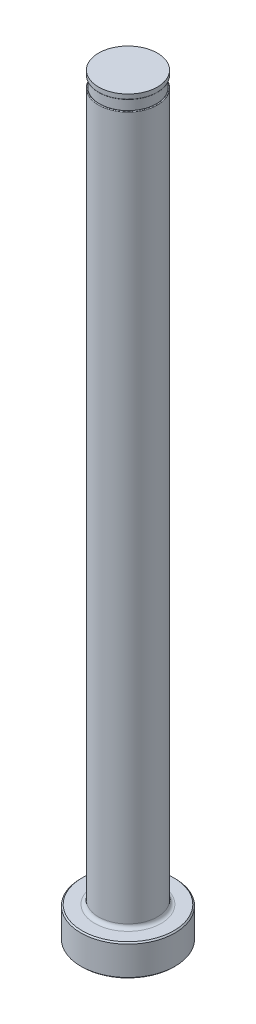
ISO-10303-21;
HEADER;
FILE_DESCRIPTION(('STEP AP214'),'2;1');
FILE_NAME('part.step','',(''),(''),'','','');
FILE_SCHEMA(('AUTOMOTIVE_DESIGN { 1 0 10303 214 1 1 1 1 }'));
ENDSEC;
DATA;
#1=APPLICATION_CONTEXT('core data for automotive mechanical design processes');
#2=APPLICATION_PROTOCOL_DEFINITION('international standard','automotive_design',2000,#1);
#3=PRODUCT_CONTEXT('',#1,'mechanical');
#4=PRODUCT('Part','Part','',(#3));
#5=PRODUCT_RELATED_PRODUCT_CATEGORY('part','',(#4));
#6=PRODUCT_DEFINITION_FORMATION('','',#4);
#7=PRODUCT_DEFINITION_CONTEXT('part definition',#1,'design');
#8=PRODUCT_DEFINITION('design','',#6,#7);
#9=PRODUCT_DEFINITION_SHAPE('','',#8);
#10=(LENGTH_UNIT() NAMED_UNIT(*) SI_UNIT(.MILLI.,.METRE.));
#11=(NAMED_UNIT(*) PLANE_ANGLE_UNIT() SI_UNIT($,.RADIAN.));
#12=(NAMED_UNIT(*) SI_UNIT($,.STERADIAN.) SOLID_ANGLE_UNIT());
#13=UNCERTAINTY_MEASURE_WITH_UNIT(LENGTH_MEASURE(1.E-05),#10,'distance_accuracy_value','');
#14=(GEOMETRIC_REPRESENTATION_CONTEXT(3) GLOBAL_UNCERTAINTY_ASSIGNED_CONTEXT((#13)) GLOBAL_UNIT_ASSIGNED_CONTEXT((#10,
#11,#12)) REPRESENTATION_CONTEXT('',''));
#15=CARTESIAN_POINT('',(0.,0.,0.));
#16=DIRECTION('',(0.,0.,1.));
#17=DIRECTION('',(1.,0.,0.));
#18=AXIS2_PLACEMENT_3D('',#15,#16,#17);
#19=CARTESIAN_POINT('',(-5.95248999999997,151.384,0.));
#20=DIRECTION('',(0.,1.,0.));
#21=DIRECTION('',(0.,0.,1.));
#22=AXIS2_PLACEMENT_3D('',#19,#20,#21);
#23=PLANE('',#22);
#24=CARTESIAN_POINT('',(0.,151.384,0.));
#25=DIRECTION('',(0.,1.,0.));
#26=DIRECTION('',(0.,0.,1.));
#27=AXIS2_PLACEMENT_3D('',#24,#25,#26);
#28=CIRCLE('',#27,5.82040999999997);
#29=CARTESIAN_POINT('',(0.,151.384,5.82040999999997));
#30=VERTEX_POINT('',#29);
#31=EDGE_CURVE('E11',#30,#30,#28,.F.);
#32=ORIENTED_EDGE('',*,*,#31,.T.);
#33=EDGE_LOOP('',(#32));
#34=FACE_BOUND('',#33,.T.);
#35=CARTESIAN_POINT('',(0.,151.384,0.));
#36=DIRECTION('',(0.,1.,0.));
#37=DIRECTION('',(0.,0.,1.));
#38=AXIS2_PLACEMENT_3D('',#35,#36,#37);
#39=CIRCLE('',#38,5.74928999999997);
#40=CARTESIAN_POINT('',(0.,151.384,5.74928999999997));
#41=VERTEX_POINT('',#40);
#42=EDGE_CURVE('E78',#41,#41,#39,.T.);
#43=ORIENTED_EDGE('',*,*,#42,.T.);
#44=EDGE_LOOP('',(#43));
#45=FACE_BOUND('',#44,.T.);
#46=ADVANCED_FACE('F36',(#34,#45),#23,.F.);
#47=CARTESIAN_POINT('',(0.,259.958771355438,0.));
#48=DIRECTION('',(0.,1.,0.));
#49=DIRECTION('',(0.,0.,1.));
#50=AXIS2_PLACEMENT_3D('',#47,#48,#49);
#51=CYLINDRICAL_SURFACE('',#50,5.95248999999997);
#52=DIRECTION('',(0.,1.,0.));
#53=VECTOR('',#52,1.);
#54=CARTESIAN_POINT('',(-5.74928999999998,259.958771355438,-1.5420122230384));
#55=LINE('',#54,#53);
#56=CARTESIAN_POINT('',(-5.74928999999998,149.225,-1.5420122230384));
#57=VERTEX_POINT('',#56);
#58=CARTESIAN_POINT('',(-5.74928999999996,86.868,-1.54201222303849));
#59=VERTEX_POINT('',#58);
#60=EDGE_CURVE('E73',#57,#59,#55,.F.);
#61=ORIENTED_EDGE('',*,*,#60,.F.);
#62=CARTESIAN_POINT('',(0.,149.225,0.));
#63=DIRECTION('',(0.,-1.,0.));
#64=DIRECTION('',(0.,0.,-1.));
#65=AXIS2_PLACEMENT_3D('',#62,#63,#64);
#66=CIRCLE('',#65,5.95248999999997);
#67=CARTESIAN_POINT('',(-5.74928999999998,149.225,1.5420122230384));
#68=VERTEX_POINT('',#67);
#69=EDGE_CURVE('E51',#57,#68,#66,.T.);
#70=ORIENTED_EDGE('',*,*,#69,.T.);
#71=DIRECTION('',(0.,1.,0.));
#72=VECTOR('',#71,1.);
#73=CARTESIAN_POINT('',(-5.74928999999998,259.958771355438,1.5420122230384));
#74=LINE('',#73,#72);
#75=CARTESIAN_POINT('',(-5.74928999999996,86.868,1.54201222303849));
#76=VERTEX_POINT('',#75);
#77=EDGE_CURVE('E84',#76,#68,#74,.T.);
#78=ORIENTED_EDGE('',*,*,#77,.F.);
#79=CARTESIAN_POINT('',(-5.74928999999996,86.868,-1.54201222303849));
#80=CARTESIAN_POINT('',(-5.7492869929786,86.8402208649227,-1.54201697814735));
#81=CARTESIAN_POINT('',(-5.74965505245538,86.8124610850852,-1.5406516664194));
#82=CARTESIAN_POINT('',(-5.75110274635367,86.7572460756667,-1.53524151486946));
#83=CARTESIAN_POINT('',(-5.75218176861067,86.7297906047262,-1.53119898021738));
#84=CARTESIAN_POINT('',(-5.75641075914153,86.6487767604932,-1.51525486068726));
#85=CARTESIAN_POINT('',(-5.76055400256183,86.5959793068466,-1.49953379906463));
#86=CARTESIAN_POINT('',(-5.77092696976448,86.4944513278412,-1.45909687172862));
#87=CARTESIAN_POINT('',(-5.77715061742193,86.445709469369,-1.43440718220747));
#88=CARTESIAN_POINT('',(-5.79098788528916,86.3529780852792,-1.37748193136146));
#89=CARTESIAN_POINT('',(-5.7986047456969,86.3090000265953,-1.34522872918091));
#90=CARTESIAN_POINT('',(-5.81685908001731,86.2141849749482,-1.26430278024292));
#91=CARTESIAN_POINT('',(-5.82772577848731,86.1651387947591,-1.21359133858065));
#92=CARTESIAN_POINT('',(-5.84932001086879,86.0759814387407,-1.10484574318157));
#93=CARTESIAN_POINT('',(-5.86004729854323,86.0358844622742,-1.04680017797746));
#94=CARTESIAN_POINT('',(-5.88390059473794,85.9519339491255,-0.904778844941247));
#95=CARTESIAN_POINT('',(-5.89659263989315,85.9114837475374,-0.818723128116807));
#96=CARTESIAN_POINT('',(-5.91855552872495,85.8445666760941,-0.641010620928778));
#97=CARTESIAN_POINT('',(-5.92782357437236,85.8181112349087,-0.549349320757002));
#98=CARTESIAN_POINT('',(-5.94230780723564,85.7776429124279,-0.360889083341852));
#99=CARTESIAN_POINT('',(-5.94742894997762,85.7639208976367,-0.2640211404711));
#100=CARTESIAN_POINT('',(-5.95288793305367,85.749318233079,-0.0691558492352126));
#101=CARTESIAN_POINT('',(-5.95322242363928,85.7484465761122,0.0288422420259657));
#102=CARTESIAN_POINT('',(-5.94868446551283,85.7605404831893,0.242237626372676));
#103=CARTESIAN_POINT('',(-5.94283113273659,85.7761121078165,0.357477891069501));
#104=CARTESIAN_POINT('',(-5.92492015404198,85.8263022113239,0.583281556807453));
#105=CARTESIAN_POINT('',(-5.91286985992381,85.8608981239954,0.69385033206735));
#106=CARTESIAN_POINT('',(-5.88892429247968,85.9362489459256,0.870563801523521));
#107=CARTESIAN_POINT('',(-5.87828331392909,85.9712292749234,0.939352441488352));
#108=CARTESIAN_POINT('',(-5.85581507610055,86.0514071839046,1.07049428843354));
#109=CARTESIAN_POINT('',(-5.8439898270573,86.0965876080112,1.13285804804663));
#110=CARTESIAN_POINT('',(-5.82307219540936,86.1863208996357,1.2353431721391));
#111=CARTESIAN_POINT('',(-5.81396107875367,86.2287467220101,1.27731748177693));
#112=CARTESIAN_POINT('',(-5.79660025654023,86.3199777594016,1.35392068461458));
#113=CARTESIAN_POINT('',(-5.78834968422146,86.3687764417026,1.38855700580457));
#114=CARTESIAN_POINT('',(-5.77487399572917,86.4634137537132,1.44347959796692));
#115=CARTESIAN_POINT('',(-5.76937362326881,86.5083804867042,1.46519744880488));
#116=CARTESIAN_POINT('',(-5.76015985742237,86.6013997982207,1.50101335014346));
#117=CARTESIAN_POINT('',(-5.75644319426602,86.6494465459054,1.51512534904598));
#118=CARTESIAN_POINT('',(-5.75233279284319,86.7262424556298,1.53063311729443));
#119=CARTESIAN_POINT('',(-5.75119737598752,86.754400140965,1.53488770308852));
#120=CARTESIAN_POINT('',(-5.74967384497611,86.8110323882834,1.54058135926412));
#121=CARTESIAN_POINT('',(-5.74928611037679,86.8395071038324,1.54201899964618));
#122=CARTESIAN_POINT('',(-5.74928999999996,86.868,1.54201222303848));
#123=B_SPLINE_CURVE_WITH_KNOTS('',3,(#79,#80,#81,#82,#83,#84,#85,#86,#87,#88,#89,#90,#91,#92,
#93,#94,#95,#96,#97,#98,#99,#100,#101,#102,#103,#104,#105,#106,#107,#108,#109,#110,#111,#112,
#113,#114,#115,#116,#117,#118,#119,#120,#121,#122),.UNSPECIFIED.,.F.,.F.,(4,2,2,2,2,2,2,2,2,2,2,
2,2,2,2,2,2,2,2,2,2,4),(0.,0.0832648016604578,0.166458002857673,0.331100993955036,
0.495267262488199,0.659820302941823,0.872804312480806,1.08612389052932,1.37238232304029,
1.65887416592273,1.95175985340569,2.24485049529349,2.59250114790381,2.939740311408,
3.17269488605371,3.40526052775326,3.58572381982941,3.7660035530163,3.91610532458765,
4.06593087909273,4.15129340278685,4.23669924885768),.UNSPECIFIED.);
#124=EDGE_CURVE('E81',#59,#76,#123,.T.);
#125=ORIENTED_EDGE('',*,*,#124,.F.);
#126=EDGE_LOOP('',(#61,#70,#78,#125));
#127=FACE_BOUND('',#126,.T.);
#128=CARTESIAN_POINT('',(0.,7.11200000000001,0.));
#129=DIRECTION('',(0.,1.,0.));
#130=DIRECTION('',(0.,0.,1.));
#131=AXIS2_PLACEMENT_3D('',#128,#129,#130);
#132=CIRCLE('',#131,5.95248999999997);
#133=CARTESIAN_POINT('',(0.,7.11200000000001,5.95248999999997));
#134=VERTEX_POINT('',#133);
#135=EDGE_CURVE('E116',#134,#134,#132,.T.);
#136=ORIENTED_EDGE('',*,*,#135,.T.);
#137=EDGE_LOOP('',(#136));
#138=FACE_BOUND('',#137,.T.);
#139=ADVANCED_FACE('F82',(#127,#138),#51,.T.);
#140=CARTESIAN_POINT('',(0.,0.,0.));
#141=DIRECTION('',(0.,-1.,0.));
#142=DIRECTION('',(0.,0.,-1.));
#143=AXIS2_PLACEMENT_3D('',#140,#141,#142);
#144=PLANE('',#143);
#145=CARTESIAN_POINT('',(0.,0.,0.));
#146=DIRECTION('',(0.,-1.,0.));
#147=DIRECTION('',(0.,0.,-1.));
#148=AXIS2_PLACEMENT_3D('',#145,#146,#147);
#149=CIRCLE('',#148,9.271);
#150=CARTESIAN_POINT('',(0.,0.,-9.271));
#151=VERTEX_POINT('',#150);
#152=EDGE_CURVE('E113',#151,#151,#149,.T.);
#153=ORIENTED_EDGE('',*,*,#152,.T.);
#154=EDGE_LOOP('',(#153));
#155=FACE_BOUND('',#154,.T.);
#156=ADVANCED_FACE('F192',(#155),#144,.T.);
#157=CARTESIAN_POINT('',(0.,259.958771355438,0.));
#158=DIRECTION('',(0.,1.,0.));
#159=DIRECTION('',(0.,0.,1.));
#160=AXIS2_PLACEMENT_3D('',#157,#158,#159);
#161=CYLINDRICAL_SURFACE('',#160,9.52499999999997);
#162=CARTESIAN_POINT('',(0.,6.09600000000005,0.));
#163=DIRECTION('',(0.,1.,0.));
#164=DIRECTION('',(0.,0.,1.));
#165=AXIS2_PLACEMENT_3D('',#162,#163,#164);
#166=CIRCLE('',#165,9.52499999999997);
#167=CARTESIAN_POINT('',(0.,6.09600000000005,9.52499999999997));
#168=VERTEX_POINT('',#167);
#169=EDGE_CURVE('E110',#168,#168,#166,.F.);
#170=ORIENTED_EDGE('',*,*,#169,.T.);
#171=EDGE_LOOP('',(#170));
#172=FACE_BOUND('',#171,.T.);
#173=CARTESIAN_POINT('',(0.,0.253999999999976,0.));
#174=DIRECTION('',(0.,-1.,0.));
#175=DIRECTION('',(0.,0.,-1.));
#176=AXIS2_PLACEMENT_3D('',#173,#174,#175);
#177=CIRCLE('',#176,9.52499999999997);
#178=CARTESIAN_POINT('',(0.,0.253999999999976,-9.52499999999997));
#179=VERTEX_POINT('',#178);
#180=EDGE_CURVE('E107',#179,#179,#177,.F.);
#181=ORIENTED_EDGE('',*,*,#180,.T.);
#182=EDGE_LOOP('',(#181));
#183=FACE_BOUND('',#182,.T.);
#184=ADVANCED_FACE('F195',(#172,#183),#161,.T.);
#185=CARTESIAN_POINT('',(-9.52499999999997,6.35,0.));
#186=DIRECTION('',(0.,1.,0.));
#187=DIRECTION('',(0.,0.,1.));
#188=AXIS2_PLACEMENT_3D('',#185,#186,#187);
#189=PLANE('',#188);
#190=CARTESIAN_POINT('',(0.,6.35,0.));
#191=DIRECTION('',(0.,1.,0.));
#192=DIRECTION('',(0.,0.,1.));
#193=AXIS2_PLACEMENT_3D('',#190,#191,#192);
#194=CIRCLE('',#193,6.71448999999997);
#195=CARTESIAN_POINT('',(0.,6.35,6.71448999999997));
#196=VERTEX_POINT('',#195);
#197=EDGE_CURVE('E87',#196,#196,#194,.F.);
#198=ORIENTED_EDGE('',*,*,#197,.T.);
#199=EDGE_LOOP('',(#198));
#200=FACE_BOUND('',#199,.T.);
#201=CARTESIAN_POINT('',(0.,6.35,0.));
#202=DIRECTION('',(0.,1.,0.));
#203=DIRECTION('',(0.,0.,1.));
#204=AXIS2_PLACEMENT_3D('',#201,#202,#203);
#205=CIRCLE('',#204,9.27100000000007);
#206=CARTESIAN_POINT('',(0.,6.35,9.27100000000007));
#207=VERTEX_POINT('',#206);
#208=EDGE_CURVE('E104',#207,#207,#205,.T.);
#209=ORIENTED_EDGE('',*,*,#208,.T.);
#210=EDGE_LOOP('',(#209));
#211=FACE_BOUND('',#210,.T.);
#212=ADVANCED_FACE('F190',(#200,#211),#189,.T.);
#213=CARTESIAN_POINT('',(0.,6.35000000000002,0.));
#214=DIRECTION('',(0.,-1.,0.));
#215=DIRECTION('',(0.,0.,-1.));
#216=AXIS2_PLACEMENT_3D('',#213,#214,#215);
#217=CONICAL_SURFACE('',#216,9.27100000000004,0.785398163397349);
#218=ORIENTED_EDGE('',*,*,#169,.F.);
#219=EDGE_LOOP('',(#218));
#220=FACE_BOUND('',#219,.T.);
#221=ORIENTED_EDGE('',*,*,#208,.F.);
#222=EDGE_LOOP('',(#221));
#223=FACE_BOUND('',#222,.T.);
#224=ADVANCED_FACE('F186',(#220,#223),#217,.T.);
#225=CARTESIAN_POINT('',(0.,0.253999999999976,0.));
#226=DIRECTION('',(0.,1.,0.));
#227=DIRECTION('',(0.,0.,1.));
#228=AXIS2_PLACEMENT_3D('',#225,#226,#227);
#229=CONICAL_SURFACE('',#228,9.52499999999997,0.785398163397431);
#230=ORIENTED_EDGE('',*,*,#152,.F.);
#231=EDGE_LOOP('',(#230));
#232=FACE_BOUND('',#231,.T.);
#233=ORIENTED_EDGE('',*,*,#180,.F.);
#234=EDGE_LOOP('',(#233));
#235=FACE_BOUND('',#234,.T.);
#236=ADVANCED_FACE('F182',(#232,#235),#229,.T.);
#237=CARTESIAN_POINT('',(0.,7.11200000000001,0.));
#238=DIRECTION('',(0.,1.,0.));
#239=DIRECTION('',(0.,0.,1.));
#240=AXIS2_PLACEMENT_3D('',#237,#238,#239);
#241=TOROIDAL_SURFACE('',#240,6.71448999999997,0.762);
#242=ORIENTED_EDGE('',*,*,#197,.F.);
#243=EDGE_LOOP('',(#242));
#244=FACE_BOUND('',#243,.T.);
#245=ORIENTED_EDGE('',*,*,#135,.F.);
#246=EDGE_LOOP('',(#245));
#247=FACE_BOUND('',#246,.T.);
#248=ADVANCED_FACE('F147',(#244,#247),#241,.F.);
#249=CARTESIAN_POINT('',(-5.95248999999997,149.352,0.));
#250=DIRECTION('',(0.,-1.,0.));
#251=DIRECTION('',(0.,0.,-1.));
#252=AXIS2_PLACEMENT_3D('',#249,#250,#251);
#253=PLANE('',#252);
#254=DIRECTION('',(0.,0.,1.));
#255=VECTOR('',#254,1.);
#256=CARTESIAN_POINT('',(-5.74928999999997,149.352,0.));
#257=LINE('',#256,#255);
#258=CARTESIAN_POINT('',(-5.74928999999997,149.352,0.));
#259=VERTEX_POINT('',#258);
#260=CARTESIAN_POINT('',(-5.74928999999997,149.352,0.939147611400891));
#261=VERTEX_POINT('',#260);
#262=EDGE_CURVE('E90',#259,#261,#257,.T.);
#263=ORIENTED_EDGE('',*,*,#262,.T.);
#264=CARTESIAN_POINT('',(0.,149.352,0.));
#265=DIRECTION('',(0.,-1.,0.));
#266=DIRECTION('',(0.,0.,-1.));
#267=AXIS2_PLACEMENT_3D('',#264,#265,#266);
#268=CIRCLE('',#267,5.82548999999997);
#269=CARTESIAN_POINT('',(-5.74928999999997,149.352,-0.939147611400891));
#270=VERTEX_POINT('',#269);
#271=EDGE_CURVE('E86',#261,#270,#268,.F.);
#272=ORIENTED_EDGE('',*,*,#271,.T.);
#273=EDGE_CURVE('E79',#270,#259,#257,.T.);
#274=ORIENTED_EDGE('',*,*,#273,.T.);
#275=CARTESIAN_POINT('',(0.,149.352,0.));
#276=DIRECTION('',(0.,1.,0.));
#277=DIRECTION('',(0.,0.,1.));
#278=AXIS2_PLACEMENT_3D('',#275,#276,#277);
#279=CIRCLE('',#278,5.74928999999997);
#280=EDGE_CURVE('E101',#259,#259,#279,.T.);
#281=ORIENTED_EDGE('',*,*,#280,.F.);
#282=EDGE_LOOP('',(#263,#272,#274,#281));
#283=FACE_BOUND('',#282,.T.);
#284=ADVANCED_FACE('F144',(#283),#253,.F.);
#285=CARTESIAN_POINT('',(0.,153.448281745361,0.));
#286=DIRECTION('',(0.,1.,0.));
#287=DIRECTION('',(0.,0.,1.));
#288=AXIS2_PLACEMENT_3D('',#285,#286,#287);
#289=CYLINDRICAL_SURFACE('',#288,5.74928999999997);
#290=ORIENTED_EDGE('',*,*,#42,.F.);
#291=EDGE_LOOP('',(#290));
#292=FACE_BOUND('',#291,.T.);
#293=ORIENTED_EDGE('',*,*,#280,.T.);
#294=EDGE_LOOP('',(#293));
#295=FACE_BOUND('',#294,.T.);
#296=ADVANCED_FACE('F141',(#292,#295),#289,.T.);
#297=CARTESIAN_POINT('',(-5.74928999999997,150.368,-9.52499999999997));
#298=DIRECTION('',(1.,0.,0.));
#299=DIRECTION('',(0.,1.,0.));
#300=AXIS2_PLACEMENT_3D('',#297,#298,#299);
#301=PLANE('',#300);
#302=ORIENTED_EDGE('',*,*,#273,.F.);
#303=CARTESIAN_POINT('',(-5.74928999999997,149.352,-0.939147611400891));
#304=CARTESIAN_POINT('',(-5.74928999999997,149.351999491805,-0.960313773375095));
#305=CARTESIAN_POINT('',(-5.74928999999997,149.351863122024,-0.981479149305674));
#306=CARTESIAN_POINT('',(-5.74928999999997,149.351255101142,-1.02381131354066));
#307=CARTESIAN_POINT('',(-5.74928999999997,149.350783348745,-1.0449781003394));
#308=CARTESIAN_POINT('',(-5.74928999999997,149.348768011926,-1.10851964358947));
#309=CARTESIAN_POINT('',(-5.74928999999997,149.346624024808,-1.15088175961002));
#310=CARTESIAN_POINT('',(-5.74928999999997,149.341688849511,-1.21286687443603));
#311=CARTESIAN_POINT('',(-5.74928999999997,149.339853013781,-1.23256518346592));
#312=CARTESIAN_POINT('',(-5.74928999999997,149.335501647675,-1.27188290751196));
#313=CARTESIAN_POINT('',(-5.74928999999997,149.332986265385,-1.2915023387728));
#314=CARTESIAN_POINT('',(-5.74928999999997,149.325966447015,-1.33801228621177));
#315=CARTESIAN_POINT('',(-5.74928999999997,149.321069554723,-1.36484781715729));
#316=CARTESIAN_POINT('',(-5.74928999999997,149.310495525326,-1.40986464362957));
#317=CARTESIAN_POINT('',(-5.74928999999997,149.305508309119,-1.42819643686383));
#318=CARTESIAN_POINT('',(-5.74928999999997,149.296514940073,-1.45484549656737));
#319=CARTESIAN_POINT('',(-5.74928999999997,149.293335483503,-1.46343850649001));
#320=CARTESIAN_POINT('',(-5.74928999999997,149.28627591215,-1.48034059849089));
#321=CARTESIAN_POINT('',(-5.74928999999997,149.282396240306,-1.48864985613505));
#322=CARTESIAN_POINT('',(-5.74928999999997,149.275506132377,-1.50120056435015));
#323=CARTESIAN_POINT('',(-5.74928999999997,149.272853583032,-1.50563682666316));
#324=CARTESIAN_POINT('',(-5.74928999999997,149.267101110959,-1.51421595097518));
#325=CARTESIAN_POINT('',(-5.74928999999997,149.26400162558,-1.51835909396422));
#326=CARTESIAN_POINT('',(-5.74928999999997,149.258471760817,-1.52466635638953));
#327=CARTESIAN_POINT('',(-5.74928999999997,149.25622570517,-1.52699040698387));
#328=CARTESIAN_POINT('',(-5.74928999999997,149.251445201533,-1.53132640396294));
#329=CARTESIAN_POINT('',(-5.74928999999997,149.248911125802,-1.53333874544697));
#330=CARTESIAN_POINT('',(-5.74928999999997,149.244334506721,-1.53634422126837));
#331=CARTESIAN_POINT('',(-5.74928999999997,149.242374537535,-1.53746164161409));
#332=CARTESIAN_POINT('',(-5.74928999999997,149.238307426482,-1.53937528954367));
#333=CARTESIAN_POINT('',(-5.74928999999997,149.236200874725,-1.54017272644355));
#334=CARTESIAN_POINT('',(-5.74928999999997,149.2325728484,-1.54117250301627));
#335=CARTESIAN_POINT('',(-5.74928999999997,149.231081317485,-1.54148377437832));
#336=CARTESIAN_POINT('',(-5.74928999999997,149.228060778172,-1.54190531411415));
#337=CARTESIAN_POINT('',(-5.74928999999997,149.226531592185,-1.54201429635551));
#338=CARTESIAN_POINT('',(-5.74928999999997,149.225000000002,-1.54201222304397));
#339=B_SPLINE_CURVE_WITH_KNOTS('',3,(#303,#304,#305,#306,#307,#308,#309,#310,#311,#312,#313,
#314,#315,#316,#317,#318,#319,#320,#321,#322,#323,#324,#325,#326,#327,#328,#329,#330,#331,#332,
#333,#334,#335,#336,#337,#338),.UNSPECIFIED.,.F.,.F.,(4,2,2,2,2,2,2,2,2,2,2,2,2,2,2,2,2,4),(0.,
0.0634959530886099,0.127011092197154,0.254202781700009,0.313544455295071,0.372873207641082,
0.45462942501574,0.511527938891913,0.538997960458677,0.566450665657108,0.581940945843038,
0.597416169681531,0.607094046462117,0.616759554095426,0.623507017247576,0.630228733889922,
0.634786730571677,0.639373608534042),.UNSPECIFIED.);
#340=EDGE_CURVE('E59',#270,#57,#339,.T.);
#341=ORIENTED_EDGE('',*,*,#340,.T.);
#342=ORIENTED_EDGE('',*,*,#60,.T.);
#343=DIRECTION('',(0.,0.,1.));
#344=VECTOR('',#343,1.);
#345=CARTESIAN_POINT('',(-5.74928999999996,86.868,-9.52499999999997));
#346=LINE('',#345,#344);
#347=EDGE_CURVE('E77',#59,#76,#346,.T.);
#348=ORIENTED_EDGE('',*,*,#347,.T.);
#349=ORIENTED_EDGE('',*,*,#77,.T.);
#350=CARTESIAN_POINT('',(-5.74928999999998,149.225,1.5420122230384));
#351=CARTESIAN_POINT('',(-5.74928999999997,149.227261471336,1.54202038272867));
#352=CARTESIAN_POINT('',(-5.74928999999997,149.229510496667,1.54177946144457));
#353=CARTESIAN_POINT('',(-5.74928999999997,149.233887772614,1.54087970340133));
#354=CARTESIAN_POINT('',(-5.74928999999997,149.236017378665,1.54022760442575));
#355=CARTESIAN_POINT('',(-5.74928999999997,149.240617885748,1.53838865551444));
#356=CARTESIAN_POINT('',(-5.74928999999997,149.243052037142,1.53711237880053));
#357=CARTESIAN_POINT('',(-5.74928999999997,149.247698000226,1.53418694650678));
#358=CARTESIAN_POINT('',(-5.74928999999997,149.249908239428,1.53253538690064));
#359=CARTESIAN_POINT('',(-5.74928999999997,149.255730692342,1.52761233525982));
#360=CARTESIAN_POINT('',(-5.74928999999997,149.259112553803,1.52407243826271));
#361=CARTESIAN_POINT('',(-5.74928999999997,149.265360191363,1.51657566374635));
#362=CARTESIAN_POINT('',(-5.74928999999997,149.26822496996,1.51261800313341));
#363=CARTESIAN_POINT('',(-5.74928999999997,149.275008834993,1.50226117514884));
#364=CARTESIAN_POINT('',(-5.74928999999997,149.278667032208,1.49569302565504));
#365=CARTESIAN_POINT('',(-5.74928999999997,149.285372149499,1.48224724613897));
#366=CARTESIAN_POINT('',(-5.74928999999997,149.288417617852,1.47536892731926));
#367=CARTESIAN_POINT('',(-5.74928999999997,149.296912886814,1.45440029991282));
#368=CARTESIAN_POINT('',(-5.74928999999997,149.301686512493,1.44003865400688));
#369=CARTESIAN_POINT('',(-5.74928999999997,149.310114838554,1.41106200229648));
#370=CARTESIAN_POINT('',(-5.74928999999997,149.313772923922,1.39644790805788));
#371=CARTESIAN_POINT('',(-5.74928999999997,149.320305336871,1.36704254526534));
#372=CARTESIAN_POINT('',(-5.74928999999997,149.323179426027,1.35225122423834));
#373=CARTESIAN_POINT('',(-5.74928999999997,149.330936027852,1.30765909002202));
#374=CARTESIAN_POINT('',(-5.74928999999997,149.334935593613,1.27770752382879));
#375=CARTESIAN_POINT('',(-5.74928999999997,149.341413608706,1.21764271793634));
#376=CARTESIAN_POINT('',(-5.74928999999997,149.343891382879,1.18752941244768));
#377=CARTESIAN_POINT('',(-5.74928999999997,149.34774393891,1.12726865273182));
#378=CARTESIAN_POINT('',(-5.74928999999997,149.349119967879,1.09712127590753));
#379=CARTESIAN_POINT('',(-5.74928999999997,149.350769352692,1.04562383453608));
#380=CARTESIAN_POINT('',(-5.74928999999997,149.351247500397,1.02427949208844));
#381=CARTESIAN_POINT('',(-5.74928999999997,149.351861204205,0.981672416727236));
#382=CARTESIAN_POINT('',(-5.74928999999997,149.351998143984,0.960409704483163));
#383=CARTESIAN_POINT('',(-5.74928999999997,149.352,0.939147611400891));
#384=B_SPLINE_CURVE_WITH_KNOTS('',3,(#350,#351,#352,#353,#354,#355,#356,#357,#358,#359,#360,
#361,#362,#363,#364,#365,#366,#367,#368,#369,#370,#371,#372,#373,#374,#375,#376,#377,#378,#379,
#380,#381,#382,#383),.UNSPECIFIED.,.F.,.F.,(4,2,2,2,2,2,2,2,2,2,2,2,2,2,2,2,4),(0.,
0.00675172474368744,0.0133955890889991,0.0215941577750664,0.029846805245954,0.0444516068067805,
0.0590842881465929,0.0815815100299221,0.104131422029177,0.149443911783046,0.194617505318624,
0.239804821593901,0.3303875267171,0.421010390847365,0.51153052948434,0.575577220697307,
0.639363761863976),.UNSPECIFIED.);
#385=EDGE_CURVE('E172',#68,#261,#384,.T.);
#386=ORIENTED_EDGE('',*,*,#385,.T.);
#387=ORIENTED_EDGE('',*,*,#262,.F.);
#388=EDGE_LOOP('',(#302,#341,#342,#348,#349,#386,#387));
#389=FACE_BOUND('',#388,.T.);
#390=ADVANCED_FACE('F75',(#389),#301,.F.);
#391=CARTESIAN_POINT('',(-8.92428999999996,86.868,-9.52499999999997));
#392=DIRECTION('',(0.,0.,1.));
#393=DIRECTION('',(1.,0.,0.));
#394=AXIS2_PLACEMENT_3D('',#391,#392,#393);
#395=CYLINDRICAL_SURFACE('',#394,3.175);
#396=ORIENTED_EDGE('',*,*,#347,.F.);
#397=ORIENTED_EDGE('',*,*,#124,.T.);
#398=EDGE_LOOP('',(#396,#397));
#399=FACE_BOUND('',#398,.T.);
#400=ADVANCED_FACE('F89',(#399),#395,.F.);
#401=CARTESIAN_POINT('',(0.,152.687735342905,0.));
#402=DIRECTION('',(0.,1.,0.));
#403=DIRECTION('',(0.,0.,1.));
#404=AXIS2_PLACEMENT_3D('',#401,#402,#403);
#405=CYLINDRICAL_SURFACE('',#404,5.94740999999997);
#406=CARTESIAN_POINT('',(0.,151.511,0.));
#407=DIRECTION('',(0.,1.,0.));
#408=DIRECTION('',(0.,0.,1.));
#409=AXIS2_PLACEMENT_3D('',#406,#407,#408);
#410=CIRCLE('',#409,5.94740999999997);
#411=CARTESIAN_POINT('',(0.,151.511,5.94740999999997));
#412=VERTEX_POINT('',#411);
#413=EDGE_CURVE('E44',#412,#412,#410,.T.);
#414=ORIENTED_EDGE('',*,*,#413,.T.);
#415=EDGE_LOOP('',(#414));
#416=FACE_BOUND('',#415,.T.);
#417=CARTESIAN_POINT('',(0.,152.4,0.));
#418=DIRECTION('',(0.,1.,0.));
#419=DIRECTION('',(0.,0.,1.));
#420=AXIS2_PLACEMENT_3D('',#417,#418,#419);
#421=CIRCLE('',#420,5.94740999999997);
#422=CARTESIAN_POINT('',(0.,152.4,5.94740999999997));
#423=VERTEX_POINT('',#422);
#424=EDGE_CURVE('E91',#423,#423,#421,.T.);
#425=ORIENTED_EDGE('',*,*,#424,.F.);
#426=EDGE_LOOP('',(#425));
#427=FACE_BOUND('',#426,.T.);
#428=ADVANCED_FACE('F135',(#416,#427),#405,.T.);
#429=CARTESIAN_POINT('',(-5.95248999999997,152.4,0.));
#430=DIRECTION('',(0.,1.,0.));
#431=DIRECTION('',(0.,0.,1.));
#432=AXIS2_PLACEMENT_3D('',#429,#430,#431);
#433=PLANE('',#432);
#434=ORIENTED_EDGE('',*,*,#424,.T.);
#435=EDGE_LOOP('',(#434));
#436=FACE_BOUND('',#435,.T.);
#437=ADVANCED_FACE('F149',(#436),#433,.T.);
#438=CARTESIAN_POINT('',(0.,149.225,0.));
#439=DIRECTION('',(0.,-1.,0.));
#440=DIRECTION('',(0.,0.,-1.));
#441=AXIS2_PLACEMENT_3D('',#438,#439,#440);
#442=TOROIDAL_SURFACE('',#441,5.82548999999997,0.127);
#443=ORIENTED_EDGE('',*,*,#385,.F.);
#444=ORIENTED_EDGE('',*,*,#69,.F.);
#445=ORIENTED_EDGE('',*,*,#340,.F.);
#446=ORIENTED_EDGE('',*,*,#271,.F.);
#447=EDGE_LOOP('',(#443,#444,#445,#446));
#448=FACE_BOUND('',#447,.T.);
#449=ADVANCED_FACE('F151',(#448),#442,.T.);
#450=CARTESIAN_POINT('',(0.,151.511,0.));
#451=DIRECTION('',(0.,1.,0.));
#452=DIRECTION('',(0.,0.,1.));
#453=AXIS2_PLACEMENT_3D('',#450,#451,#452);
#454=TOROIDAL_SURFACE('',#453,5.82040999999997,0.127);
#455=ORIENTED_EDGE('',*,*,#31,.F.);
#456=EDGE_LOOP('',(#455));
#457=FACE_BOUND('',#456,.T.);
#458=ORIENTED_EDGE('',*,*,#413,.F.);
#459=EDGE_LOOP('',(#458));
#460=FACE_BOUND('',#459,.T.);
#461=ADVANCED_FACE('F38',(#457,#460),#454,.T.);
#462=CLOSED_SHELL('',(#46,#139,#156,#184,#212,#224,#236,#248,#284,#296,#390,#400,#428,#437,#449,#461));
#463=MANIFOLD_SOLID_BREP('B2',#462);
#464=ADVANCED_BREP_SHAPE_REPRESENTATION('',(#18,#463),#14);
#465=SHAPE_DEFINITION_REPRESENTATION(#9,#464);
ENDSEC;
END-ISO-10303-21;
